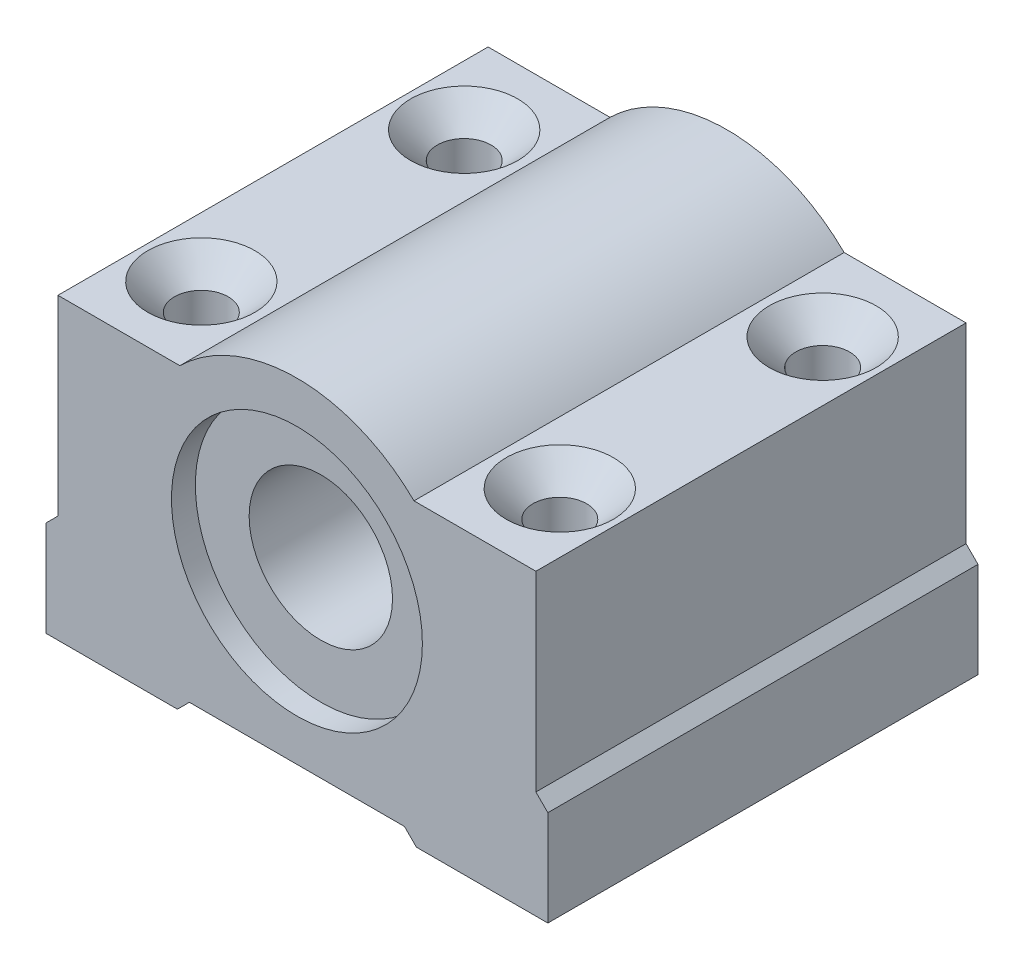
from build123d import *

# Parameters (mm, degrees)
SKETCH1_R                     = 6
BOSS_EXTRUDE1_DEPTH           = 18
SKETCH2_R                     = 10.5
CUT_EXTRUDE1_DEPTH            = 2
CSK_FOR_M4_SFHCS1_D           = 4.5
CSK_FOR_M4_SFHCS1_CSINK_D     = 8.96
CSK_FOR_M4_SFHCS1_CSINK_ANGLE = 90
LPATTERN1_COUNT               = 2
LPATTERN1_PITCH               = 22
LPATTERN1_COUNT_DIR2          = 2
LPATTERN1_PITCH_DIR2          = 30


with BuildPart() as part:
    # Sketch1 → Boss-Extrude1 (new, symmetric)
    with BuildSketch(Plane.XY):
        with BuildLine():
            Line((0, 0), (0, 8))
            Line((0, 8), (1, 9))
            Line((1, 9), (1, 25))
            Line((1, 25), (11.202041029, 25))
            ThreePointArc((11.202041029, 25), (21, 29), (30.797958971, 25))
            Line((30.797958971, 25), (41, 25))
            Line((41, 25), (41, 9))
            Line((41, 9), (42, 8))
            Line((42, 8), (42, 0))
            Line((42, 0), (31, 0))
            Line((31, 0), (30, 1))
            Line((30, 1), (12, 1))
            Line((12, 1), (11, 0))
            Line((11, 0), (0, 0))
        make_face()
        with Locations((21, 15)):
            Circle(SKETCH1_R, mode=Mode.SUBTRACT)
    extrude(amount=BOSS_EXTRUDE1_DEPTH, both=True)

    # Sketch2 → Cut-Extrude1 (cut)
    with BuildSketch(Plane.XY.offset(18)):
        with Locations((21, 15)):
            Circle(SKETCH2_R)
    cut_extrude1 = extrude(amount=-CUT_EXTRUDE1_DEPTH, mode=Mode.SUBTRACT)

    # Mirror1: Cut-Extrude1 across plane
    add(cut_extrude1.mirror(Plane.XY), mode=Mode.SUBTRACT)

    # CSK for M4 SFHCS1 (through all)
    with Locations(Plane(origin=(0, 25, 0), x_dir=(1, 0, 0), z_dir=(0, 1, 0))):
        with Locations((36, -11)):
            csk_for_m4_sfhcs1 = CounterSinkHole(CSK_FOR_M4_SFHCS1_D / 2, CSK_FOR_M4_SFHCS1_CSINK_D / 2, counter_sink_angle=CSK_FOR_M4_SFHCS1_CSINK_ANGLE)

    # LPattern1: CSK for M4 SFHCS1 2 × 2
    with Locations(*[(-j * LPATTERN1_PITCH_DIR2, 0, -i * LPATTERN1_PITCH) for i in range(LPATTERN1_COUNT) for j in range(LPATTERN1_COUNT_DIR2) if (i, j) != (0, 0)]):
        add(csk_for_m4_sfhcs1, mode=Mode.SUBTRACT)


solid = part.part
